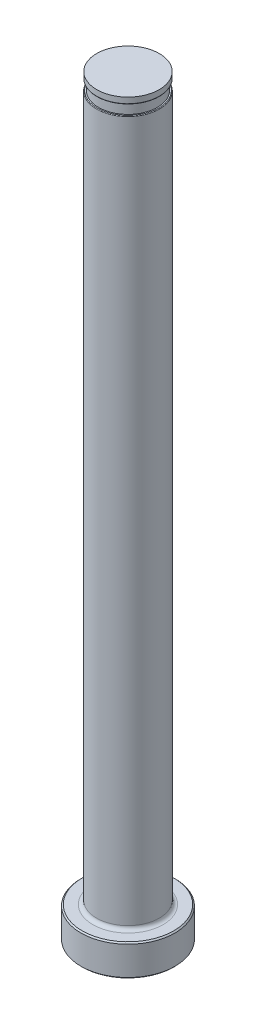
ISO-10303-21;
HEADER;
FILE_DESCRIPTION(('STEP AP214'),'2;1');
FILE_NAME('part.step','',(''),(''),'','','');
FILE_SCHEMA(('AUTOMOTIVE_DESIGN { 1 0 10303 214 1 1 1 1 }'));
ENDSEC;
DATA;
#1=APPLICATION_CONTEXT('core data for automotive mechanical design processes');
#2=APPLICATION_PROTOCOL_DEFINITION('international standard','automotive_design',2000,#1);
#3=PRODUCT_CONTEXT('',#1,'mechanical');
#4=PRODUCT('Part','Part','',(#3));
#5=PRODUCT_RELATED_PRODUCT_CATEGORY('part','',(#4));
#6=PRODUCT_DEFINITION_FORMATION('','',#4);
#7=PRODUCT_DEFINITION_CONTEXT('part definition',#1,'design');
#8=PRODUCT_DEFINITION('design','',#6,#7);
#9=PRODUCT_DEFINITION_SHAPE('','',#8);
#10=(LENGTH_UNIT() NAMED_UNIT(*) SI_UNIT(.MILLI.,.METRE.));
#11=(NAMED_UNIT(*) PLANE_ANGLE_UNIT() SI_UNIT($,.RADIAN.));
#12=(NAMED_UNIT(*) SI_UNIT($,.STERADIAN.) SOLID_ANGLE_UNIT());
#13=UNCERTAINTY_MEASURE_WITH_UNIT(LENGTH_MEASURE(1.E-05),#10,'distance_accuracy_value','');
#14=(GEOMETRIC_REPRESENTATION_CONTEXT(3) GLOBAL_UNCERTAINTY_ASSIGNED_CONTEXT((#13)) GLOBAL_UNIT_ASSIGNED_CONTEXT((#10,
#11,#12)) REPRESENTATION_CONTEXT('',''));
#15=CARTESIAN_POINT('',(0.,0.,0.));
#16=DIRECTION('',(0.,0.,1.));
#17=DIRECTION('',(1.,0.,0.));
#18=AXIS2_PLACEMENT_3D('',#15,#16,#17);
#19=CARTESIAN_POINT('',(-6.34999999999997,151.13,0.));
#20=DIRECTION('',(0.,1.,0.));
#21=DIRECTION('',(0.,0.,1.));
#22=AXIS2_PLACEMENT_3D('',#19,#20,#21);
#23=PLANE('',#22);
#24=CARTESIAN_POINT('',(0.,151.13,0.));
#25=DIRECTION('',(0.,1.,0.));
#26=DIRECTION('',(0.,0.,1.));
#27=AXIS2_PLACEMENT_3D('',#24,#25,#26);
#28=CIRCLE('',#27,6.21029999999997);
#29=CARTESIAN_POINT('',(0.,151.13,6.21029999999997));
#30=VERTEX_POINT('',#29);
#31=EDGE_CURVE('E11',#30,#30,#28,.F.);
#32=ORIENTED_EDGE('',*,*,#31,.T.);
#33=EDGE_LOOP('',(#32));
#34=FACE_BOUND('',#33,.T.);
#35=CARTESIAN_POINT('',(0.,151.13,0.));
#36=DIRECTION('',(0.,1.,0.));
#37=DIRECTION('',(0.,0.,1.));
#38=AXIS2_PLACEMENT_3D('',#35,#36,#37);
#39=CIRCLE('',#38,5.96899999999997);
#40=CARTESIAN_POINT('',(0.,151.13,5.96899999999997));
#41=VERTEX_POINT('',#40);
#42=EDGE_CURVE('E79',#41,#41,#39,.T.);
#43=ORIENTED_EDGE('',*,*,#42,.T.);
#44=EDGE_LOOP('',(#43));
#45=FACE_BOUND('',#44,.T.);
#46=ADVANCED_FACE('F37',(#34,#45),#23,.F.);
#47=CARTESIAN_POINT('',(0.,259.958771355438,0.));
#48=DIRECTION('',(0.,1.,0.));
#49=DIRECTION('',(0.,0.,1.));
#50=AXIS2_PLACEMENT_3D('',#47,#48,#49);
#51=CYLINDRICAL_SURFACE('',#50,6.34999999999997);
#52=DIRECTION('',(0.,1.,0.));
#53=VECTOR('',#52,1.);
#54=CARTESIAN_POINT('',(-5.96899999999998,259.958771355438,-2.16645770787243));
#55=LINE('',#54,#53);
#56=CARTESIAN_POINT('',(-5.96899999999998,148.971,-2.16645770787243));
#57=VERTEX_POINT('',#56);
#58=CARTESIAN_POINT('',(-5.96899999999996,86.614,-2.16645770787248));
#59=VERTEX_POINT('',#58);
#60=EDGE_CURVE('E74',#57,#59,#55,.F.);
#61=ORIENTED_EDGE('',*,*,#60,.F.);
#62=CARTESIAN_POINT('',(0.,148.971,0.));
#63=DIRECTION('',(0.,-1.,0.));
#64=DIRECTION('',(0.,0.,-1.));
#65=AXIS2_PLACEMENT_3D('',#62,#63,#64);
#66=CIRCLE('',#65,6.34999999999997);
#67=CARTESIAN_POINT('',(-5.96899999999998,148.971,2.16645770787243));
#68=VERTEX_POINT('',#67);
#69=EDGE_CURVE('E52',#57,#68,#66,.T.);
#70=ORIENTED_EDGE('',*,*,#69,.T.);
#71=DIRECTION('',(0.,1.,0.));
#72=VECTOR('',#71,1.);
#73=CARTESIAN_POINT('',(-5.96899999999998,259.958771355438,2.16645770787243));
#74=LINE('',#73,#72);
#75=CARTESIAN_POINT('',(-5.96899999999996,86.614,2.16645770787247));
#76=VERTEX_POINT('',#75);
#77=EDGE_CURVE('E85',#76,#68,#74,.T.);
#78=ORIENTED_EDGE('',*,*,#77,.F.);
#79=CARTESIAN_POINT('',(-5.96899999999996,86.614,-2.16645770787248));
#80=CARTESIAN_POINT('',(-5.96899632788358,86.5799156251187,-2.16646187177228));
#81=CARTESIAN_POINT('',(-5.96954950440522,86.5458517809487,-2.16494423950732));
#82=CARTESIAN_POINT('',(-5.97173147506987,86.4780460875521,-2.1589207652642));
#83=CARTESIAN_POINT('',(-5.97335956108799,86.444304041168,-2.15441689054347));
#84=CARTESIAN_POINT('',(-5.97976311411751,86.344493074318,-2.13660914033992));
#85=CARTESIAN_POINT('',(-5.98605927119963,86.2792410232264,-2.11900689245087));
#86=CARTESIAN_POINT('',(-6.00198076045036,86.1531432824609,-2.07347402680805));
#87=CARTESIAN_POINT('',(-6.01159880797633,86.0922883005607,-2.04556599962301));
#88=CARTESIAN_POINT('',(-6.03322374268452,85.9758688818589,-1.98087780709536));
#89=CARTESIAN_POINT('',(-6.04523522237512,85.9203149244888,-1.94408055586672));
#90=CARTESIAN_POINT('',(-6.0751043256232,85.7967819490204,-1.84901520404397));
#91=CARTESIAN_POINT('',(-6.09353665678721,85.7312598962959,-1.78774003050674));
#92=CARTESIAN_POINT('',(-6.13083819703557,85.6112825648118,-1.6553195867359));
#93=CARTESIAN_POINT('',(-6.14970810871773,85.5568466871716,-1.5841573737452));
#94=CARTESIAN_POINT('',(-6.19314441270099,85.4399816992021,-1.40662723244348));
#95=CARTESIAN_POINT('',(-6.2171903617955,85.3822219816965,-1.29707088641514));
#96=CARTESIAN_POINT('',(-6.26036703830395,85.2842829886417,-1.06947966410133));
#97=CARTESIAN_POINT('',(-6.27949018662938,85.2441307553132,-0.951432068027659));
#98=CARTESIAN_POINT('',(-6.30567101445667,85.1909642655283,-0.753130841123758));
#99=CARTESIAN_POINT('',(-6.31460325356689,85.1733750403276,-0.674296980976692));
#100=CARTESIAN_POINT('',(-6.32956878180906,85.1443490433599,-0.51520440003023));
#101=CARTESIAN_POINT('',(-6.335601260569,85.1329139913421,-0.434945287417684));
#102=CARTESIAN_POINT('',(-6.34462001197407,85.1159388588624,-0.273566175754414));
#103=CARTESIAN_POINT('',(-6.34760330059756,85.1104045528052,-0.19244541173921));
#104=CARTESIAN_POINT('',(-6.35044913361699,85.1051236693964,-0.029960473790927));
#105=CARTESIAN_POINT('',(-6.35031162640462,85.1053771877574,0.0514037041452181));
#106=CARTESIAN_POINT('',(-6.34690227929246,85.1117075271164,0.214603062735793));
#107=CARTESIAN_POINT('',(-6.34360118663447,85.1178386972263,0.296435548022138));
#108=CARTESIAN_POINT('',(-6.33389931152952,85.1361412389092,0.459197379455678));
#109=CARTESIAN_POINT('',(-6.32750017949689,85.1483093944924,0.540127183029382));
#110=CARTESIAN_POINT('',(-6.31176692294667,85.1789464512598,0.700407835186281));
#111=CARTESIAN_POINT('',(-6.30243632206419,85.1974077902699,0.77976045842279));
#112=CARTESIAN_POINT('',(-6.28110432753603,85.2410324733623,0.936195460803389));
#113=CARTESIAN_POINT('',(-6.26910424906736,85.2661925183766,1.01327893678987));
#114=CARTESIAN_POINT('',(-6.23850818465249,85.3331696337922,1.18904804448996));
#115=CARTESIAN_POINT('',(-6.2190382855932,85.3777431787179,1.28655990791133));
#116=CARTESIAN_POINT('',(-6.17749204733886,85.481061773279,1.47315670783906));
#117=CARTESIAN_POINT('',(-6.15541977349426,85.5397848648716,1.56225440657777));
#118=CARTESIAN_POINT('',(-6.11623336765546,85.6568718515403,1.70836145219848));
#119=CARTESIAN_POINT('',(-6.09918730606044,85.7120056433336,1.76796497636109));
#120=CARTESIAN_POINT('',(-6.06632840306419,85.8314510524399,1.87761146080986));
#121=CARTESIAN_POINT('',(-6.05051415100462,85.89575192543,1.92766545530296));
#122=CARTESIAN_POINT('',(-6.02447937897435,86.0202964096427,2.00738184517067));
#123=CARTESIAN_POINT('',(-6.0137649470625,86.079116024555,2.03910101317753));
#124=CARTESIAN_POINT('',(-5.99531072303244,86.2014615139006,2.09273895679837));
#125=CARTESIAN_POINT('',(-5.9875654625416,86.2649784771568,2.11467576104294));
#126=CARTESIAN_POINT('',(-5.97757531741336,86.3762408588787,2.14272088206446));
#127=CARTESIAN_POINT('',(-5.97438690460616,86.4232225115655,2.15157394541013));
#128=CARTESIAN_POINT('',(-5.97008663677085,86.5181204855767,2.16346390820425));
#129=CARTESIAN_POINT('',(-5.96897978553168,86.5660387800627,2.16648679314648));
#130=CARTESIAN_POINT('',(-5.96899999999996,86.614,2.16645770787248));
#131=B_SPLINE_CURVE_WITH_KNOTS('',3,(#79,#80,#81,#82,#83,#84,#85,#86,#87,#88,#89,#90,#91,#92,
#93,#94,#95,#96,#97,#98,#99,#100,#101,#102,#103,#104,#105,#106,#107,#108,#109,#110,#111,#112,
#113,#114,#115,#116,#117,#118,#119,#120,#121,#122,#123,#124,#125,#126,#127,#128,#129,#130),
.UNSPECIFIED.,.F.,.F.,(4,2,2,2,2,2,2,2,2,2,2,2,2,2,2,2,2,2,2,2,2,2,2,2,2,4),(0.,
0.102175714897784,0.204284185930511,0.406734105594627,0.608742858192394,0.811143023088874,
1.0843861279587,1.35810338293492,1.73456300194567,2.11159879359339,2.35511796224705,
2.59870514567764,2.84253048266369,3.08635985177,3.33246581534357,3.57844081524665,
3.82412127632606,4.06968096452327,4.39549786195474,4.72081235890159,4.96882848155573,
5.21655626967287,5.41878357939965,5.62063663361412,5.76399316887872,5.90769387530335),.UNSPECIFIED.);
#132=EDGE_CURVE('E82',#59,#76,#131,.T.);
#133=ORIENTED_EDGE('',*,*,#132,.F.);
#134=EDGE_LOOP('',(#61,#70,#78,#133));
#135=FACE_BOUND('',#134,.T.);
#136=CARTESIAN_POINT('',(0.,7.11200000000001,0.));
#137=DIRECTION('',(0.,1.,0.));
#138=DIRECTION('',(0.,0.,1.));
#139=AXIS2_PLACEMENT_3D('',#136,#137,#138);
#140=CIRCLE('',#139,6.34999999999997);
#141=CARTESIAN_POINT('',(0.,7.11200000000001,6.34999999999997));
#142=VERTEX_POINT('',#141);
#143=EDGE_CURVE('E117',#142,#142,#140,.T.);
#144=ORIENTED_EDGE('',*,*,#143,.T.);
#145=EDGE_LOOP('',(#144));
#146=FACE_BOUND('',#145,.T.);
#147=ADVANCED_FACE('F83',(#135,#146),#51,.T.);
#148=CARTESIAN_POINT('',(0.,0.,0.));
#149=DIRECTION('',(0.,-1.,0.));
#150=DIRECTION('',(0.,0.,-1.));
#151=AXIS2_PLACEMENT_3D('',#148,#149,#150);
#152=PLANE('',#151);
#153=CARTESIAN_POINT('',(0.,0.,0.));
#154=DIRECTION('',(0.,-1.,0.));
#155=DIRECTION('',(0.,0.,-1.));
#156=AXIS2_PLACEMENT_3D('',#153,#154,#155);
#157=CIRCLE('',#156,9.271);
#158=CARTESIAN_POINT('',(0.,0.,-9.271));
#159=VERTEX_POINT('',#158);
#160=EDGE_CURVE('E114',#159,#159,#157,.T.);
#161=ORIENTED_EDGE('',*,*,#160,.T.);
#162=EDGE_LOOP('',(#161));
#163=FACE_BOUND('',#162,.T.);
#164=ADVANCED_FACE('F193',(#163),#152,.T.);
#165=CARTESIAN_POINT('',(0.,259.958771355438,0.));
#166=DIRECTION('',(0.,1.,0.));
#167=DIRECTION('',(0.,0.,1.));
#168=AXIS2_PLACEMENT_3D('',#165,#166,#167);
#169=CYLINDRICAL_SURFACE('',#168,9.52499999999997);
#170=CARTESIAN_POINT('',(0.,6.09600000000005,0.));
#171=DIRECTION('',(0.,1.,0.));
#172=DIRECTION('',(0.,0.,1.));
#173=AXIS2_PLACEMENT_3D('',#170,#171,#172);
#174=CIRCLE('',#173,9.52499999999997);
#175=CARTESIAN_POINT('',(0.,6.09600000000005,9.52499999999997));
#176=VERTEX_POINT('',#175);
#177=EDGE_CURVE('E111',#176,#176,#174,.F.);
#178=ORIENTED_EDGE('',*,*,#177,.T.);
#179=EDGE_LOOP('',(#178));
#180=FACE_BOUND('',#179,.T.);
#181=CARTESIAN_POINT('',(0.,0.253999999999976,0.));
#182=DIRECTION('',(0.,-1.,0.));
#183=DIRECTION('',(0.,0.,-1.));
#184=AXIS2_PLACEMENT_3D('',#181,#182,#183);
#185=CIRCLE('',#184,9.52499999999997);
#186=CARTESIAN_POINT('',(0.,0.253999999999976,-9.52499999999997));
#187=VERTEX_POINT('',#186);
#188=EDGE_CURVE('E108',#187,#187,#185,.F.);
#189=ORIENTED_EDGE('',*,*,#188,.T.);
#190=EDGE_LOOP('',(#189));
#191=FACE_BOUND('',#190,.T.);
#192=ADVANCED_FACE('F196',(#180,#191),#169,.T.);
#193=CARTESIAN_POINT('',(-9.52499999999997,6.35,0.));
#194=DIRECTION('',(0.,1.,0.));
#195=DIRECTION('',(0.,0.,1.));
#196=AXIS2_PLACEMENT_3D('',#193,#194,#195);
#197=PLANE('',#196);
#198=CARTESIAN_POINT('',(0.,6.35,0.));
#199=DIRECTION('',(0.,1.,0.));
#200=DIRECTION('',(0.,0.,1.));
#201=AXIS2_PLACEMENT_3D('',#198,#199,#200);
#202=CIRCLE('',#201,7.11199999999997);
#203=CARTESIAN_POINT('',(0.,6.35,7.11199999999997));
#204=VERTEX_POINT('',#203);
#205=EDGE_CURVE('E88',#204,#204,#202,.F.);
#206=ORIENTED_EDGE('',*,*,#205,.T.);
#207=EDGE_LOOP('',(#206));
#208=FACE_BOUND('',#207,.T.);
#209=CARTESIAN_POINT('',(0.,6.35,0.));
#210=DIRECTION('',(0.,1.,0.));
#211=DIRECTION('',(0.,0.,1.));
#212=AXIS2_PLACEMENT_3D('',#209,#210,#211);
#213=CIRCLE('',#212,9.27100000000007);
#214=CARTESIAN_POINT('',(0.,6.35,9.27100000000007));
#215=VERTEX_POINT('',#214);
#216=EDGE_CURVE('E105',#215,#215,#213,.T.);
#217=ORIENTED_EDGE('',*,*,#216,.T.);
#218=EDGE_LOOP('',(#217));
#219=FACE_BOUND('',#218,.T.);
#220=ADVANCED_FACE('F191',(#208,#219),#197,.T.);
#221=CARTESIAN_POINT('',(0.,6.35000000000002,0.));
#222=DIRECTION('',(0.,-1.,0.));
#223=DIRECTION('',(0.,0.,-1.));
#224=AXIS2_PLACEMENT_3D('',#221,#222,#223);
#225=CONICAL_SURFACE('',#224,9.27100000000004,0.785398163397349);
#226=ORIENTED_EDGE('',*,*,#177,.F.);
#227=EDGE_LOOP('',(#226));
#228=FACE_BOUND('',#227,.T.);
#229=ORIENTED_EDGE('',*,*,#216,.F.);
#230=EDGE_LOOP('',(#229));
#231=FACE_BOUND('',#230,.T.);
#232=ADVANCED_FACE('F187',(#228,#231),#225,.T.);
#233=CARTESIAN_POINT('',(0.,0.253999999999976,0.));
#234=DIRECTION('',(0.,1.,0.));
#235=DIRECTION('',(0.,0.,1.));
#236=AXIS2_PLACEMENT_3D('',#233,#234,#235);
#237=CONICAL_SURFACE('',#236,9.52499999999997,0.785398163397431);
#238=ORIENTED_EDGE('',*,*,#160,.F.);
#239=EDGE_LOOP('',(#238));
#240=FACE_BOUND('',#239,.T.);
#241=ORIENTED_EDGE('',*,*,#188,.F.);
#242=EDGE_LOOP('',(#241));
#243=FACE_BOUND('',#242,.T.);
#244=ADVANCED_FACE('F183',(#240,#243),#237,.T.);
#245=CARTESIAN_POINT('',(0.,7.11200000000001,0.));
#246=DIRECTION('',(0.,1.,0.));
#247=DIRECTION('',(0.,0.,1.));
#248=AXIS2_PLACEMENT_3D('',#245,#246,#247);
#249=TOROIDAL_SURFACE('',#248,7.11199999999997,0.762);
#250=ORIENTED_EDGE('',*,*,#205,.F.);
#251=EDGE_LOOP('',(#250));
#252=FACE_BOUND('',#251,.T.);
#253=ORIENTED_EDGE('',*,*,#143,.F.);
#254=EDGE_LOOP('',(#253));
#255=FACE_BOUND('',#254,.T.);
#256=ADVANCED_FACE('F148',(#252,#255),#249,.F.);
#257=CARTESIAN_POINT('',(-6.34999999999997,149.098,0.));
#258=DIRECTION('',(0.,-1.,0.));
#259=DIRECTION('',(0.,0.,-1.));
#260=AXIS2_PLACEMENT_3D('',#257,#258,#259);
#261=PLANE('',#260);
#262=DIRECTION('',(0.,0.,1.));
#263=VECTOR('',#262,1.);
#264=CARTESIAN_POINT('',(-5.96899999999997,149.098,0.));
#265=LINE('',#264,#263);
#266=CARTESIAN_POINT('',(-5.96899999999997,149.098,0.));
#267=VERTEX_POINT('',#266);
#268=CARTESIAN_POINT('',(-5.96899999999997,149.098,1.75976362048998));
#269=VERTEX_POINT('',#268);
#270=EDGE_CURVE('E91',#267,#269,#265,.T.);
#271=ORIENTED_EDGE('',*,*,#270,.T.);
#272=CARTESIAN_POINT('',(0.,149.098,0.));
#273=DIRECTION('',(0.,-1.,0.));
#274=DIRECTION('',(0.,0.,-1.));
#275=AXIS2_PLACEMENT_3D('',#272,#273,#274);
#276=CIRCLE('',#275,6.22299999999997);
#277=CARTESIAN_POINT('',(-5.96899999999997,149.098,-1.75976362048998));
#278=VERTEX_POINT('',#277);
#279=EDGE_CURVE('E87',#269,#278,#276,.F.);
#280=ORIENTED_EDGE('',*,*,#279,.T.);
#281=EDGE_CURVE('E80',#278,#267,#265,.T.);
#282=ORIENTED_EDGE('',*,*,#281,.T.);
#283=CARTESIAN_POINT('',(0.,149.098,0.));
#284=DIRECTION('',(0.,1.,0.));
#285=DIRECTION('',(0.,0.,1.));
#286=AXIS2_PLACEMENT_3D('',#283,#284,#285);
#287=CIRCLE('',#286,5.96899999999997);
#288=EDGE_CURVE('E102',#267,#267,#287,.T.);
#289=ORIENTED_EDGE('',*,*,#288,.F.);
#290=EDGE_LOOP('',(#271,#280,#282,#289));
#291=FACE_BOUND('',#290,.T.);
#292=ADVANCED_FACE('F145',(#291),#261,.F.);
#293=CARTESIAN_POINT('',(0.,153.448281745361,0.));
#294=DIRECTION('',(0.,1.,0.));
#295=DIRECTION('',(0.,0.,1.));
#296=AXIS2_PLACEMENT_3D('',#293,#294,#295);
#297=CYLINDRICAL_SURFACE('',#296,5.96899999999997);
#298=ORIENTED_EDGE('',*,*,#42,.F.);
#299=EDGE_LOOP('',(#298));
#300=FACE_BOUND('',#299,.T.);
#301=ORIENTED_EDGE('',*,*,#288,.T.);
#302=EDGE_LOOP('',(#301));
#303=FACE_BOUND('',#302,.T.);
#304=ADVANCED_FACE('F142',(#300,#303),#297,.T.);
#305=CARTESIAN_POINT('',(-5.96899999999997,150.114,-9.52499999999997));
#306=DIRECTION('',(1.,0.,0.));
#307=DIRECTION('',(0.,1.,0.));
#308=AXIS2_PLACEMENT_3D('',#305,#306,#307);
#309=PLANE('',#308);
#310=ORIENTED_EDGE('',*,*,#281,.F.);
#311=CARTESIAN_POINT('',(-5.96899999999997,149.098,-1.75976362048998));
#312=CARTESIAN_POINT('',(-5.96899999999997,149.097987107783,-1.78102486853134));
#313=CARTESIAN_POINT('',(-5.96899999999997,149.097571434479,-1.80229472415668));
#314=CARTESIAN_POINT('',(-5.96899999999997,149.095764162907,-1.84486815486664));
#315=CARTESIAN_POINT('',(-5.96899999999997,149.094369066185,-1.86617157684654));
#316=CARTESIAN_POINT('',(-5.96899999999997,149.090429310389,-1.90868534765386));
#317=CARTESIAN_POINT('',(-5.96899999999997,149.087884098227,-1.92989564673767));
#318=CARTESIAN_POINT('',(-5.96899999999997,149.081343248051,-1.97207310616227));
#319=CARTESIAN_POINT('',(-5.96899999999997,149.077349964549,-1.99304060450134));
#320=CARTESIAN_POINT('',(-5.96899999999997,149.070047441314,-2.02327100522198));
#321=CARTESIAN_POINT('',(-5.96899999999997,149.067537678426,-2.03272693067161));
#322=CARTESIAN_POINT('',(-5.96899999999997,149.061984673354,-2.05150871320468));
#323=CARTESIAN_POINT('',(-5.96899999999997,149.058940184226,-2.06083421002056));
#324=CARTESIAN_POINT('',(-5.96899999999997,149.051766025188,-2.08037686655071));
#325=CARTESIAN_POINT('',(-5.96899999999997,149.047548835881,-2.09056218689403));
#326=CARTESIAN_POINT('',(-5.96899999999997,149.037957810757,-2.11035962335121));
#327=CARTESIAN_POINT('',(-5.96899999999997,149.032589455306,-2.11997418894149));
#328=CARTESIAN_POINT('',(-5.96899999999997,149.023936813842,-2.13243175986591));
#329=CARTESIAN_POINT('',(-5.96899999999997,149.021408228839,-2.13579501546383));
#330=CARTESIAN_POINT('',(-5.96899999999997,149.016022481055,-2.14226959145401));
#331=CARTESIAN_POINT('',(-5.96899999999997,149.013164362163,-2.14538013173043));
#332=CARTESIAN_POINT('',(-5.96899999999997,149.007019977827,-2.15125392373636));
#333=CARTESIAN_POINT('',(-5.96899999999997,149.00372793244,-2.15401126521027));
#334=CARTESIAN_POINT('',(-5.96899999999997,148.996721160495,-2.15888387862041));
#335=CARTESIAN_POINT('',(-5.96899999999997,148.993010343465,-2.1610045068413));
#336=CARTESIAN_POINT('',(-5.96899999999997,148.986264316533,-2.16385169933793));
#337=CARTESIAN_POINT('',(-5.96899999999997,148.983325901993,-2.16480157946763));
#338=CARTESIAN_POINT('',(-5.96899999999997,148.977266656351,-2.16611631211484));
#339=CARTESIAN_POINT('',(-5.96899999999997,148.974143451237,-2.16646997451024));
#340=CARTESIAN_POINT('',(-5.96899999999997,148.971,-2.16645770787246));
#341=B_SPLINE_CURVE_WITH_KNOTS('',3,(#311,#312,#313,#314,#315,#316,#317,#318,#319,#320,#321,
#322,#323,#324,#325,#326,#327,#328,#329,#330,#331,#332,#333,#334,#335,#336,#337,#338,#339,#340),
.UNSPECIFIED.,.F.,.F.,(4,2,2,2,2,2,2,2,2,2,2,2,2,2,4),(0.,0.0637935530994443,0.127816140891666,
0.191869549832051,0.255819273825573,0.285158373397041,0.314566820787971,0.347601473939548,
0.380482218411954,0.393090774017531,0.405736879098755,0.418572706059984,0.431297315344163,
0.440504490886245,0.44988262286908),.UNSPECIFIED.);
#342=EDGE_CURVE('E60',#278,#57,#341,.T.);
#343=ORIENTED_EDGE('',*,*,#342,.T.);
#344=ORIENTED_EDGE('',*,*,#60,.T.);
#345=DIRECTION('',(0.,0.,1.));
#346=VECTOR('',#345,1.);
#347=CARTESIAN_POINT('',(-5.96899999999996,86.614,-9.52499999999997));
#348=LINE('',#347,#346);
#349=EDGE_CURVE('E78',#59,#76,#348,.T.);
#350=ORIENTED_EDGE('',*,*,#349,.T.);
#351=ORIENTED_EDGE('',*,*,#77,.T.);
#352=CARTESIAN_POINT('',(-5.96899999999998,148.971,2.16645770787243));
#353=CARTESIAN_POINT('',(-5.96899999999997,148.973783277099,2.16646617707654));
#354=CARTESIAN_POINT('',(-5.96899999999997,148.976554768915,2.16618995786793));
#355=CARTESIAN_POINT('',(-5.96899999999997,148.981968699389,2.16514827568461));
#356=CARTESIAN_POINT('',(-5.96899999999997,148.984612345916,2.16438920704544));
#357=CARTESIAN_POINT('',(-5.96899999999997,148.990373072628,2.16222032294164));
#358=CARTESIAN_POINT('',(-5.96899999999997,148.993446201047,2.16069621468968));
#359=CARTESIAN_POINT('',(-5.96899999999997,148.999319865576,2.15717471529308));
#360=CARTESIAN_POINT('',(-5.96899999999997,149.002118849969,2.15517482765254));
#361=CARTESIAN_POINT('',(-5.96899999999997,149.00927700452,2.14935607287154));
#362=CARTESIAN_POINT('',(-5.96899999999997,149.013385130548,2.14523220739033));
#363=CARTESIAN_POINT('',(-5.96899999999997,149.020973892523,2.13645364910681));
#364=CARTESIAN_POINT('',(-5.96899999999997,149.024453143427,2.13179782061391));
#365=CARTESIAN_POINT('',(-5.96899999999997,149.036524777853,2.11388978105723));
#366=CARTESIAN_POINT('',(-5.96899999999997,149.043605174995,2.0996402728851));
#367=CARTESIAN_POINT('',(-5.96899999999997,149.055848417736,2.07025308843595));
#368=CARTESIAN_POINT('',(-5.96899999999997,149.060987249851,2.05510681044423));
#369=CARTESIAN_POINT('',(-5.96899999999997,149.07227798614,2.01630082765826));
#370=CARTESIAN_POINT('',(-5.96899999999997,149.07752688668,1.99237753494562));
#371=CARTESIAN_POINT('',(-5.96899999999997,149.085990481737,1.94413725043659));
#372=CARTESIAN_POINT('',(-5.96899999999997,149.089198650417,1.91981924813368));
#373=CARTESIAN_POINT('',(-5.96899999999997,149.093884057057,1.87282047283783));
#374=CARTESIAN_POINT('',(-5.96899999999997,149.095470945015,1.85015036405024));
#375=CARTESIAN_POINT('',(-5.96899999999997,149.097516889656,1.8049038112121));
#376=CARTESIAN_POINT('',(-5.96899999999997,149.097983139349,1.78232770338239));
#377=CARTESIAN_POINT('',(-5.96899999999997,149.098,1.75976362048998));
#378=B_SPLINE_CURVE_WITH_KNOTS('',3,(#352,#353,#354,#355,#356,#357,#358,#359,#360,#361,#362,
#363,#364,#365,#366,#367,#368,#369,#370,#371,#372,#373,#374,#375,#376,#377),.UNSPECIFIED.,.F.,
.F.,(4,2,2,2,2,2,2,2,2,2,2,2,4),(0.,0.00831720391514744,0.0165264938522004,0.0267595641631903,
0.0370475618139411,0.0544117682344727,0.0718137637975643,0.119181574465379,0.167117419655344,
0.240420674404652,0.313957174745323,0.382102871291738,0.44980998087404),.UNSPECIFIED.);
#379=EDGE_CURVE('E173',#68,#269,#378,.T.);
#380=ORIENTED_EDGE('',*,*,#379,.T.);
#381=ORIENTED_EDGE('',*,*,#270,.F.);
#382=EDGE_LOOP('',(#310,#343,#344,#350,#351,#380,#381));
#383=FACE_BOUND('',#382,.T.);
#384=ADVANCED_FACE('F76',(#383),#309,.F.);
#385=CARTESIAN_POINT('',(-9.14399999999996,86.614,-9.52499999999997));
#386=DIRECTION('',(0.,0.,1.));
#387=DIRECTION('',(1.,0.,0.));
#388=AXIS2_PLACEMENT_3D('',#385,#386,#387);
#389=CYLINDRICAL_SURFACE('',#388,3.175);
#390=ORIENTED_EDGE('',*,*,#349,.F.);
#391=ORIENTED_EDGE('',*,*,#132,.T.);
#392=EDGE_LOOP('',(#390,#391));
#393=FACE_BOUND('',#392,.T.);
#394=ADVANCED_FACE('F90',(#393),#389,.F.);
#395=CARTESIAN_POINT('',(0.,152.687735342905,0.));
#396=DIRECTION('',(0.,1.,0.));
#397=DIRECTION('',(0.,0.,1.));
#398=AXIS2_PLACEMENT_3D('',#395,#396,#397);
#399=CYLINDRICAL_SURFACE('',#398,6.33729999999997);
#400=CARTESIAN_POINT('',(0.,151.257,0.));
#401=DIRECTION('',(0.,1.,0.));
#402=DIRECTION('',(0.,0.,1.));
#403=AXIS2_PLACEMENT_3D('',#400,#401,#402);
#404=CIRCLE('',#403,6.33729999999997);
#405=CARTESIAN_POINT('',(0.,151.257,6.33729999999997));
#406=VERTEX_POINT('',#405);
#407=EDGE_CURVE('E45',#406,#406,#404,.T.);
#408=ORIENTED_EDGE('',*,*,#407,.T.);
#409=EDGE_LOOP('',(#408));
#410=FACE_BOUND('',#409,.T.);
#411=CARTESIAN_POINT('',(0.,152.4,0.));
#412=DIRECTION('',(0.,1.,0.));
#413=DIRECTION('',(0.,0.,1.));
#414=AXIS2_PLACEMENT_3D('',#411,#412,#413);
#415=CIRCLE('',#414,6.33729999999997);
#416=CARTESIAN_POINT('',(0.,152.4,6.33729999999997));
#417=VERTEX_POINT('',#416);
#418=EDGE_CURVE('E92',#417,#417,#415,.T.);
#419=ORIENTED_EDGE('',*,*,#418,.F.);
#420=EDGE_LOOP('',(#419));
#421=FACE_BOUND('',#420,.T.);
#422=ADVANCED_FACE('F136',(#410,#421),#399,.T.);
#423=CARTESIAN_POINT('',(-6.34999999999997,152.4,0.));
#424=DIRECTION('',(0.,1.,0.));
#425=DIRECTION('',(0.,0.,1.));
#426=AXIS2_PLACEMENT_3D('',#423,#424,#425);
#427=PLANE('',#426);
#428=ORIENTED_EDGE('',*,*,#418,.T.);
#429=EDGE_LOOP('',(#428));
#430=FACE_BOUND('',#429,.T.);
#431=ADVANCED_FACE('F150',(#430),#427,.T.);
#432=CARTESIAN_POINT('',(0.,148.971,0.));
#433=DIRECTION('',(0.,-1.,0.));
#434=DIRECTION('',(0.,0.,-1.));
#435=AXIS2_PLACEMENT_3D('',#432,#433,#434);
#436=TOROIDAL_SURFACE('',#435,6.22299999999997,0.127);
#437=ORIENTED_EDGE('',*,*,#379,.F.);
#438=ORIENTED_EDGE('',*,*,#69,.F.);
#439=ORIENTED_EDGE('',*,*,#342,.F.);
#440=ORIENTED_EDGE('',*,*,#279,.F.);
#441=EDGE_LOOP('',(#437,#438,#439,#440));
#442=FACE_BOUND('',#441,.T.);
#443=ADVANCED_FACE('F152',(#442),#436,.T.);
#444=CARTESIAN_POINT('',(0.,151.257,0.));
#445=DIRECTION('',(0.,1.,0.));
#446=DIRECTION('',(0.,0.,1.));
#447=AXIS2_PLACEMENT_3D('',#444,#445,#446);
#448=TOROIDAL_SURFACE('',#447,6.21029999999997,0.127);
#449=ORIENTED_EDGE('',*,*,#31,.F.);
#450=EDGE_LOOP('',(#449));
#451=FACE_BOUND('',#450,.T.);
#452=ORIENTED_EDGE('',*,*,#407,.F.);
#453=EDGE_LOOP('',(#452));
#454=FACE_BOUND('',#453,.T.);
#455=ADVANCED_FACE('F39',(#451,#454),#448,.T.);
#456=CLOSED_SHELL('',(#46,#147,#164,#192,#220,#232,#244,#256,#292,#304,#384,#394,#422,#431,#443,#455));
#457=MANIFOLD_SOLID_BREP('B2',#456);
#458=ADVANCED_BREP_SHAPE_REPRESENTATION('',(#18,#457),#14);
#459=SHAPE_DEFINITION_REPRESENTATION(#9,#458);
ENDSEC;
END-ISO-10303-21;
